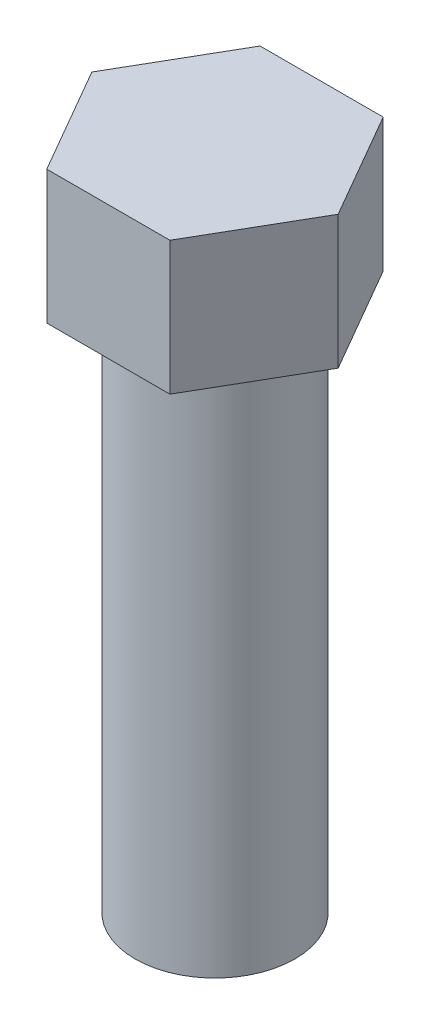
from build123d import *

# Parameters (mm, degrees)
SKETCH1_R           = 6
BOSS_EXTRUDE1_DEPTH = 40
BOSS_EXTRUDE2_DEPTH = 10


with BuildPart() as part:
    # Sketch1 → Boss-Extrude1 (new body)
    with BuildSketch(Plane(origin=(0, 0, 0), x_dir=(1, 0, 0), z_dir=(0, 1, 0))):
        with Locations(Location((0, 0, 0), (0, 0, 270))):
            Circle(SKETCH1_R)
    extrude(amount=BOSS_EXTRUDE1_DEPTH)

    # Sketch2 → Boss-Extrude2 (add)
    with BuildSketch(Plane(origin=(0, 40, 0), x_dir=(1, 0, 0), z_dir=(0, 1, 0))):
        Polygon((9.237604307, 0), (4.618802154, 8), (-4.618802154, 8), (-9.237604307, 0), (-4.618802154, -8), (4.618802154, -8), align=None)
    extrude(amount=BOSS_EXTRUDE2_DEPTH)


solid = part.part
